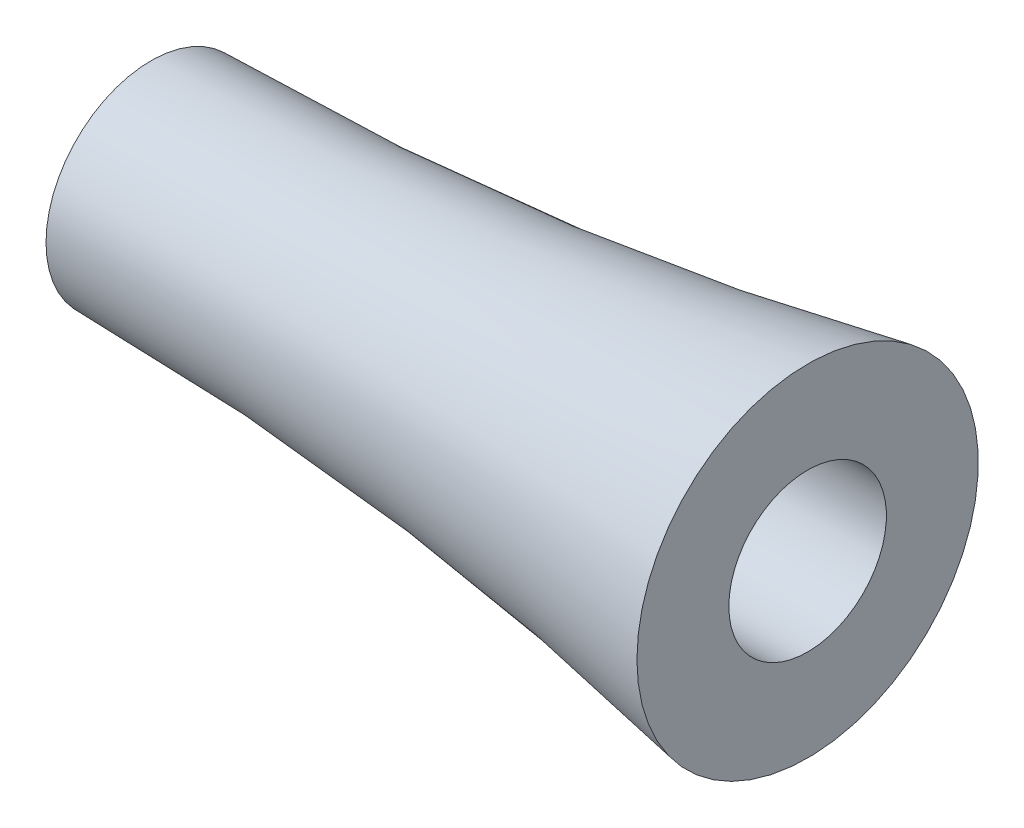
from build123d import *


with BuildPart() as part:
    # Esquisse1 → R_volution1 (revolve)
    with BuildSketch(Plane.XY, mode=Mode.PRIVATE) as r_volution1_sk:
        with BuildLine():
            Line((-18.371069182, 0), (6.628930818, 0))
            Line((6.628930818, 0), (6.628930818, 3.5))
            ThreePointArc((6.628930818, 3.5), (-5.808724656, 1.626554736), (-18.371069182, 1))
            Line((-18.371069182, 1), (-18.371069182, 0))
        make_face()
    revolve(r_volution1_sk.sketch.rotate(Axis((-18.371069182, -3, 0), (1, 0, 0)), 90), axis=Axis((-18.371069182, -3, 0), (1, 0, 0)))


solid = part.part
